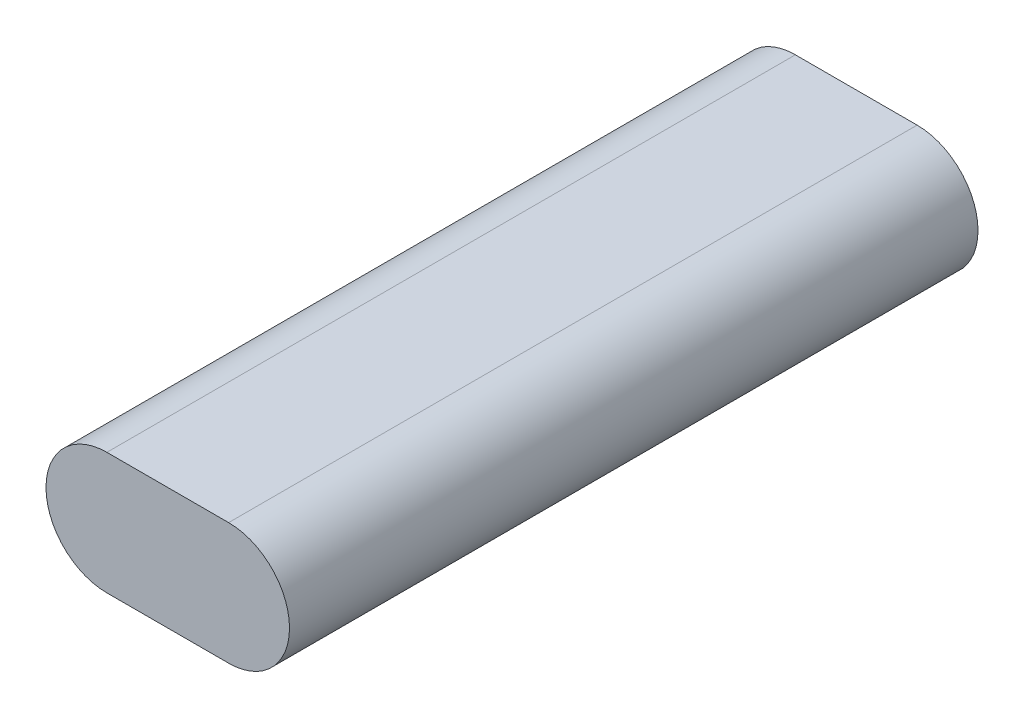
ISO-10303-21;
HEADER;
FILE_DESCRIPTION(('STEP AP214'),'2;1');
FILE_NAME('part.step','',(''),(''),'','','');
FILE_SCHEMA(('AUTOMOTIVE_DESIGN { 1 0 10303 214 1 1 1 1 }'));
ENDSEC;
DATA;
#1=APPLICATION_CONTEXT('core data for automotive mechanical design processes');
#2=APPLICATION_PROTOCOL_DEFINITION('international standard','automotive_design',2000,#1);
#3=PRODUCT_CONTEXT('',#1,'mechanical');
#4=PRODUCT('Part','Part','',(#3));
#5=PRODUCT_RELATED_PRODUCT_CATEGORY('part','',(#4));
#6=PRODUCT_DEFINITION_FORMATION('','',#4);
#7=PRODUCT_DEFINITION_CONTEXT('part definition',#1,'design');
#8=PRODUCT_DEFINITION('design','',#6,#7);
#9=PRODUCT_DEFINITION_SHAPE('','',#8);
#10=(LENGTH_UNIT() NAMED_UNIT(*) SI_UNIT(.MILLI.,.METRE.));
#11=(NAMED_UNIT(*) PLANE_ANGLE_UNIT() SI_UNIT($,.RADIAN.));
#12=(NAMED_UNIT(*) SI_UNIT($,.STERADIAN.) SOLID_ANGLE_UNIT());
#13=UNCERTAINTY_MEASURE_WITH_UNIT(LENGTH_MEASURE(1.E-05),#10,'distance_accuracy_value','');
#14=(GEOMETRIC_REPRESENTATION_CONTEXT(3) GLOBAL_UNCERTAINTY_ASSIGNED_CONTEXT((#13)) GLOBAL_UNIT_ASSIGNED_CONTEXT((#10,
#11,#12)) REPRESENTATION_CONTEXT('',''));
#15=CARTESIAN_POINT('',(0.,0.,0.));
#16=DIRECTION('',(0.,0.,1.));
#17=DIRECTION('',(1.,0.,0.));
#18=AXIS2_PLACEMENT_3D('',#15,#16,#17);
#19=CARTESIAN_POINT('',(0.,0.,130.175));
#20=DIRECTION('',(0.,0.,-1.));
#21=DIRECTION('',(-1.,0.,0.));
#22=AXIS2_PLACEMENT_3D('',#19,#20,#21);
#23=CYLINDRICAL_SURFACE('',#22,11.509375);
#24=CARTESIAN_POINT('',(0.,0.,0.));
#25=DIRECTION('',(0.,0.,1.));
#26=DIRECTION('',(-1.,0.,0.));
#27=AXIS2_PLACEMENT_3D('',#24,#25,#26);
#28=CIRCLE('',#27,11.509375);
#29=CARTESIAN_POINT('',(0.,11.509375,0.));
#30=VERTEX_POINT('',#29);
#31=CARTESIAN_POINT('',(0.,-11.509375,0.));
#32=VERTEX_POINT('',#31);
#33=EDGE_CURVE('E94',#30,#32,#28,.T.);
#34=ORIENTED_EDGE('',*,*,#33,.T.);
#35=DIRECTION('',(0.,0.,-1.));
#36=VECTOR('',#35,1.);
#37=CARTESIAN_POINT('',(0.,-11.509375,130.175));
#38=LINE('',#37,#36);
#39=CARTESIAN_POINT('',(0.,-11.509375,130.175));
#40=VERTEX_POINT('',#39);
#41=EDGE_CURVE('E11',#40,#32,#38,.T.);
#42=ORIENTED_EDGE('',*,*,#41,.F.);
#43=CARTESIAN_POINT('',(0.,0.,130.175));
#44=DIRECTION('',(0.,0.,1.));
#45=DIRECTION('',(-1.,0.,0.));
#46=AXIS2_PLACEMENT_3D('',#43,#44,#45);
#47=CIRCLE('',#46,11.509375);
#48=CARTESIAN_POINT('',(0.,11.509375,130.175));
#49=VERTEX_POINT('',#48);
#50=EDGE_CURVE('E82',#49,#40,#47,.T.);
#51=ORIENTED_EDGE('',*,*,#50,.F.);
#52=DIRECTION('',(0.,0.,-1.));
#53=VECTOR('',#52,1.);
#54=CARTESIAN_POINT('',(0.,11.509375,130.175));
#55=LINE('',#54,#53);
#56=EDGE_CURVE('E90',#49,#30,#55,.T.);
#57=ORIENTED_EDGE('',*,*,#56,.T.);
#58=EDGE_LOOP('',(#34,#42,#51,#57));
#59=FACE_BOUND('',#58,.T.);
#60=ADVANCED_FACE('F31',(#59),#23,.T.);
#61=CARTESIAN_POINT('',(0.,-11.509375,130.175));
#62=DIRECTION('',(0.,1.,0.));
#63=DIRECTION('',(-1.,0.,0.));
#64=AXIS2_PLACEMENT_3D('',#61,#62,#63);
#65=PLANE('',#64);
#66=DIRECTION('',(1.,0.,0.));
#67=VECTOR('',#66,1.);
#68=CARTESIAN_POINT('',(0.,-11.509375,0.));
#69=LINE('',#68,#67);
#70=CARTESIAN_POINT('',(23.01875,-11.509375,0.));
#71=VERTEX_POINT('',#70);
#72=EDGE_CURVE('E86',#32,#71,#69,.T.);
#73=ORIENTED_EDGE('',*,*,#72,.T.);
#74=DIRECTION('',(0.,0.,-1.));
#75=VECTOR('',#74,1.);
#76=CARTESIAN_POINT('',(23.01875,-11.509375,130.175));
#77=LINE('',#76,#75);
#78=CARTESIAN_POINT('',(23.01875,-11.509375,130.175));
#79=VERTEX_POINT('',#78);
#80=EDGE_CURVE('E39',#79,#71,#77,.T.);
#81=ORIENTED_EDGE('',*,*,#80,.F.);
#82=DIRECTION('',(1.,0.,0.));
#83=VECTOR('',#82,1.);
#84=CARTESIAN_POINT('',(0.,-11.509375,130.175));
#85=LINE('',#84,#83);
#86=EDGE_CURVE('E77',#40,#79,#85,.T.);
#87=ORIENTED_EDGE('',*,*,#86,.F.);
#88=ORIENTED_EDGE('',*,*,#41,.T.);
#89=EDGE_LOOP('',(#73,#81,#87,#88));
#90=FACE_BOUND('',#89,.T.);
#91=ADVANCED_FACE('F85',(#90),#65,.F.);
#92=CARTESIAN_POINT('',(23.01875,0.,130.175));
#93=DIRECTION('',(0.,0.,-1.));
#94=DIRECTION('',(-1.,0.,0.));
#95=AXIS2_PLACEMENT_3D('',#92,#93,#94);
#96=CYLINDRICAL_SURFACE('',#95,11.509375);
#97=CARTESIAN_POINT('',(23.01875,0.,0.));
#98=DIRECTION('',(0.,0.,1.));
#99=DIRECTION('',(-1.,0.,0.));
#100=AXIS2_PLACEMENT_3D('',#97,#98,#99);
#101=CIRCLE('',#100,11.509375);
#102=CARTESIAN_POINT('',(23.01875,11.509375,0.));
#103=VERTEX_POINT('',#102);
#104=EDGE_CURVE('E64',#71,#103,#101,.T.);
#105=ORIENTED_EDGE('',*,*,#104,.T.);
#106=DIRECTION('',(0.,0.,-1.));
#107=VECTOR('',#106,1.);
#108=CARTESIAN_POINT('',(23.01875,11.509375,130.175));
#109=LINE('',#108,#107);
#110=CARTESIAN_POINT('',(23.01875,11.509375,130.175));
#111=VERTEX_POINT('',#110);
#112=EDGE_CURVE('E87',#111,#103,#109,.T.);
#113=ORIENTED_EDGE('',*,*,#112,.F.);
#114=CARTESIAN_POINT('',(23.01875,0.,130.175));
#115=DIRECTION('',(0.,0.,1.));
#116=DIRECTION('',(-1.,0.,0.));
#117=AXIS2_PLACEMENT_3D('',#114,#115,#116);
#118=CIRCLE('',#117,11.509375);
#119=EDGE_CURVE('E80',#79,#111,#118,.T.);
#120=ORIENTED_EDGE('',*,*,#119,.F.);
#121=ORIENTED_EDGE('',*,*,#80,.T.);
#122=EDGE_LOOP('',(#105,#113,#120,#121));
#123=FACE_BOUND('',#122,.T.);
#124=ADVANCED_FACE('F88',(#123),#96,.T.);
#125=CARTESIAN_POINT('',(0.,11.509375,130.175));
#126=DIRECTION('',(0.,-1.,0.));
#127=DIRECTION('',(0.,0.,-1.));
#128=AXIS2_PLACEMENT_3D('',#125,#126,#127);
#129=PLANE('',#128);
#130=DIRECTION('',(-1.,0.,0.));
#131=VECTOR('',#130,1.);
#132=CARTESIAN_POINT('',(0.,11.509375,0.));
#133=LINE('',#132,#131);
#134=EDGE_CURVE('E70',#103,#30,#133,.T.);
#135=ORIENTED_EDGE('',*,*,#134,.T.);
#136=ORIENTED_EDGE('',*,*,#56,.F.);
#137=DIRECTION('',(-1.,0.,0.));
#138=VECTOR('',#137,1.);
#139=CARTESIAN_POINT('',(0.,11.509375,130.175));
#140=LINE('',#139,#138);
#141=EDGE_CURVE('E47',#111,#49,#140,.T.);
#142=ORIENTED_EDGE('',*,*,#141,.F.);
#143=ORIENTED_EDGE('',*,*,#112,.T.);
#144=EDGE_LOOP('',(#135,#136,#142,#143));
#145=FACE_BOUND('',#144,.T.);
#146=ADVANCED_FACE('F101',(#145),#129,.F.);
#147=CARTESIAN_POINT('',(0.,0.,130.175));
#148=DIRECTION('',(0.,0.,-1.));
#149=DIRECTION('',(-1.,0.,0.));
#150=AXIS2_PLACEMENT_3D('',#147,#148,#149);
#151=PLANE('',#150);
#152=ORIENTED_EDGE('',*,*,#50,.T.);
#153=ORIENTED_EDGE('',*,*,#86,.T.);
#154=ORIENTED_EDGE('',*,*,#119,.T.);
#155=ORIENTED_EDGE('',*,*,#141,.T.);
#156=EDGE_LOOP('',(#152,#153,#154,#155));
#157=FACE_BOUND('',#156,.T.);
#158=ADVANCED_FACE('F78',(#157),#151,.F.);
#159=CARTESIAN_POINT('',(0.,0.,0.));
#160=DIRECTION('',(0.,0.,-1.));
#161=DIRECTION('',(-1.,0.,0.));
#162=AXIS2_PLACEMENT_3D('',#159,#160,#161);
#163=PLANE('',#162);
#164=ORIENTED_EDGE('',*,*,#33,.F.);
#165=ORIENTED_EDGE('',*,*,#134,.F.);
#166=ORIENTED_EDGE('',*,*,#104,.F.);
#167=ORIENTED_EDGE('',*,*,#72,.F.);
#168=EDGE_LOOP('',(#164,#165,#166,#167));
#169=FACE_BOUND('',#168,.T.);
#170=ADVANCED_FACE('F104',(#169),#163,.T.);
#171=CLOSED_SHELL('',(#60,#91,#124,#146,#158,#170));
#172=MANIFOLD_SOLID_BREP('B2',#171);
#173=ADVANCED_BREP_SHAPE_REPRESENTATION('',(#18,#172),#14);
#174=SHAPE_DEFINITION_REPRESENTATION(#9,#173);
ENDSEC;
END-ISO-10303-21;
